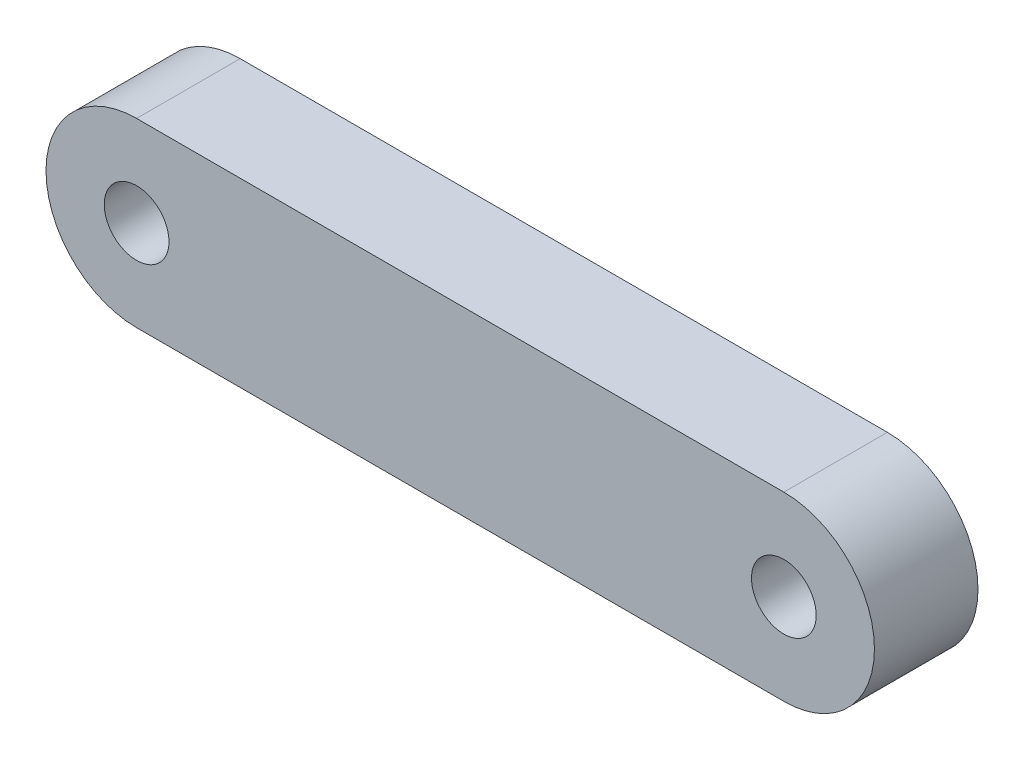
ISO-10303-21;
HEADER;
FILE_DESCRIPTION(('STEP AP214'),'2;1');
FILE_NAME('part.step','',(''),(''),'','','');
FILE_SCHEMA(('AUTOMOTIVE_DESIGN { 1 0 10303 214 1 1 1 1 }'));
ENDSEC;
DATA;
#1=APPLICATION_CONTEXT('core data for automotive mechanical design processes');
#2=APPLICATION_PROTOCOL_DEFINITION('international standard','automotive_design',2000,#1);
#3=PRODUCT_CONTEXT('',#1,'mechanical');
#4=PRODUCT('Part','Part','',(#3));
#5=PRODUCT_RELATED_PRODUCT_CATEGORY('part','',(#4));
#6=PRODUCT_DEFINITION_FORMATION('','',#4);
#7=PRODUCT_DEFINITION_CONTEXT('part definition',#1,'design');
#8=PRODUCT_DEFINITION('design','',#6,#7);
#9=PRODUCT_DEFINITION_SHAPE('','',#8);
#10=(LENGTH_UNIT() NAMED_UNIT(*) SI_UNIT(.MILLI.,.METRE.));
#11=(NAMED_UNIT(*) PLANE_ANGLE_UNIT() SI_UNIT($,.RADIAN.));
#12=(NAMED_UNIT(*) SI_UNIT($,.STERADIAN.) SOLID_ANGLE_UNIT());
#13=UNCERTAINTY_MEASURE_WITH_UNIT(LENGTH_MEASURE(1.E-05),#10,'distance_accuracy_value','');
#14=(GEOMETRIC_REPRESENTATION_CONTEXT(3) GLOBAL_UNCERTAINTY_ASSIGNED_CONTEXT((#13)) GLOBAL_UNIT_ASSIGNED_CONTEXT((#10,
#11,#12)) REPRESENTATION_CONTEXT('',''));
#15=CARTESIAN_POINT('',(0.,0.,0.));
#16=DIRECTION('',(0.,0.,1.));
#17=DIRECTION('',(1.,0.,0.));
#18=AXIS2_PLACEMENT_3D('',#15,#16,#17);
#19=CARTESIAN_POINT('',(-44.45,-29.21,5.08));
#20=DIRECTION('',(0.,0.,-1.));
#21=DIRECTION('',(-1.,0.,0.));
#22=AXIS2_PLACEMENT_3D('',#19,#20,#21);
#23=CYLINDRICAL_SURFACE('',#22,4.445);
#24=CARTESIAN_POINT('',(-44.45,-29.21,0.));
#25=DIRECTION('',(0.,0.,1.));
#26=DIRECTION('',(1.,0.,0.));
#27=AXIS2_PLACEMENT_3D('',#24,#25,#26);
#28=CIRCLE('',#27,4.445);
#29=CARTESIAN_POINT('',(-44.45,-33.655,0.));
#30=VERTEX_POINT('',#29);
#31=CARTESIAN_POINT('',(-44.45,-24.765,0.));
#32=VERTEX_POINT('',#31);
#33=EDGE_CURVE('E94',#30,#32,#28,.T.);
#34=ORIENTED_EDGE('',*,*,#33,.T.);
#35=DIRECTION('',(0.,0.,-1.));
#36=VECTOR('',#35,1.);
#37=CARTESIAN_POINT('',(-44.45,-24.765,5.08));
#38=LINE('',#37,#36);
#39=CARTESIAN_POINT('',(-44.45,-24.765,5.08));
#40=VERTEX_POINT('',#39);
#41=EDGE_CURVE('E11',#40,#32,#38,.T.);
#42=ORIENTED_EDGE('',*,*,#41,.F.);
#43=CARTESIAN_POINT('',(-44.45,-29.21,5.08));
#44=DIRECTION('',(0.,0.,1.));
#45=DIRECTION('',(1.,0.,0.));
#46=AXIS2_PLACEMENT_3D('',#43,#44,#45);
#47=CIRCLE('',#46,4.445);
#48=CARTESIAN_POINT('',(-44.45,-33.655,5.08));
#49=VERTEX_POINT('',#48);
#50=EDGE_CURVE('E82',#49,#40,#47,.T.);
#51=ORIENTED_EDGE('',*,*,#50,.F.);
#52=DIRECTION('',(0.,0.,-1.));
#53=VECTOR('',#52,1.);
#54=CARTESIAN_POINT('',(-44.45,-33.655,5.08));
#55=LINE('',#54,#53);
#56=EDGE_CURVE('E90',#49,#30,#55,.T.);
#57=ORIENTED_EDGE('',*,*,#56,.T.);
#58=EDGE_LOOP('',(#34,#42,#51,#57));
#59=FACE_BOUND('',#58,.T.);
#60=ADVANCED_FACE('F31',(#59),#23,.T.);
#61=CARTESIAN_POINT('',(-44.45,-24.765,5.08));
#62=DIRECTION('',(0.,-1.,0.));
#63=DIRECTION('',(1.,0.,0.));
#64=AXIS2_PLACEMENT_3D('',#61,#62,#63);
#65=PLANE('',#64);
#66=DIRECTION('',(-1.,0.,0.));
#67=VECTOR('',#66,1.);
#68=CARTESIAN_POINT('',(-44.45,-24.765,0.));
#69=LINE('',#68,#67);
#70=CARTESIAN_POINT('',(-76.2,-24.765,0.));
#71=VERTEX_POINT('',#70);
#72=EDGE_CURVE('E86',#32,#71,#69,.T.);
#73=ORIENTED_EDGE('',*,*,#72,.T.);
#74=DIRECTION('',(0.,0.,-1.));
#75=VECTOR('',#74,1.);
#76=CARTESIAN_POINT('',(-76.2,-24.765,5.08));
#77=LINE('',#76,#75);
#78=CARTESIAN_POINT('',(-76.2,-24.765,5.08));
#79=VERTEX_POINT('',#78);
#80=EDGE_CURVE('E39',#79,#71,#77,.T.);
#81=ORIENTED_EDGE('',*,*,#80,.F.);
#82=DIRECTION('',(-1.,0.,0.));
#83=VECTOR('',#82,1.);
#84=CARTESIAN_POINT('',(-44.45,-24.765,5.08));
#85=LINE('',#84,#83);
#86=EDGE_CURVE('E77',#40,#79,#85,.T.);
#87=ORIENTED_EDGE('',*,*,#86,.F.);
#88=ORIENTED_EDGE('',*,*,#41,.T.);
#89=EDGE_LOOP('',(#73,#81,#87,#88));
#90=FACE_BOUND('',#89,.T.);
#91=ADVANCED_FACE('F85',(#90),#65,.F.);
#92=CARTESIAN_POINT('',(-76.2,-29.21,5.08));
#93=DIRECTION('',(0.,0.,-1.));
#94=DIRECTION('',(-1.,0.,0.));
#95=AXIS2_PLACEMENT_3D('',#92,#93,#94);
#96=CYLINDRICAL_SURFACE('',#95,4.445);
#97=CARTESIAN_POINT('',(-76.2,-29.21,0.));
#98=DIRECTION('',(0.,0.,1.));
#99=DIRECTION('',(1.,0.,0.));
#100=AXIS2_PLACEMENT_3D('',#97,#98,#99);
#101=CIRCLE('',#100,4.445);
#102=CARTESIAN_POINT('',(-76.2,-33.655,0.));
#103=VERTEX_POINT('',#102);
#104=EDGE_CURVE('E64',#71,#103,#101,.T.);
#105=ORIENTED_EDGE('',*,*,#104,.T.);
#106=DIRECTION('',(0.,0.,-1.));
#107=VECTOR('',#106,1.);
#108=CARTESIAN_POINT('',(-76.2,-33.655,5.08));
#109=LINE('',#108,#107);
#110=CARTESIAN_POINT('',(-76.2,-33.655,5.08));
#111=VERTEX_POINT('',#110);
#112=EDGE_CURVE('E87',#111,#103,#109,.T.);
#113=ORIENTED_EDGE('',*,*,#112,.F.);
#114=CARTESIAN_POINT('',(-76.2,-29.21,5.08));
#115=DIRECTION('',(0.,0.,1.));
#116=DIRECTION('',(1.,0.,0.));
#117=AXIS2_PLACEMENT_3D('',#114,#115,#116);
#118=CIRCLE('',#117,4.445);
#119=EDGE_CURVE('E80',#79,#111,#118,.T.);
#120=ORIENTED_EDGE('',*,*,#119,.F.);
#121=ORIENTED_EDGE('',*,*,#80,.T.);
#122=EDGE_LOOP('',(#105,#113,#120,#121));
#123=FACE_BOUND('',#122,.T.);
#124=ADVANCED_FACE('F88',(#123),#96,.T.);
#125=CARTESIAN_POINT('',(-44.45,-33.655,5.08));
#126=DIRECTION('',(0.,1.,0.));
#127=DIRECTION('',(-1.,0.,0.));
#128=AXIS2_PLACEMENT_3D('',#125,#126,#127);
#129=PLANE('',#128);
#130=DIRECTION('',(1.,0.,0.));
#131=VECTOR('',#130,1.);
#132=CARTESIAN_POINT('',(-44.45,-33.655,0.));
#133=LINE('',#132,#131);
#134=EDGE_CURVE('E70',#103,#30,#133,.T.);
#135=ORIENTED_EDGE('',*,*,#134,.T.);
#136=ORIENTED_EDGE('',*,*,#56,.F.);
#137=DIRECTION('',(1.,0.,0.));
#138=VECTOR('',#137,1.);
#139=CARTESIAN_POINT('',(-44.45,-33.655,5.08));
#140=LINE('',#139,#138);
#141=EDGE_CURVE('E47',#111,#49,#140,.T.);
#142=ORIENTED_EDGE('',*,*,#141,.F.);
#143=ORIENTED_EDGE('',*,*,#112,.T.);
#144=EDGE_LOOP('',(#135,#136,#142,#143));
#145=FACE_BOUND('',#144,.T.);
#146=ADVANCED_FACE('F102',(#145),#129,.F.);
#147=CARTESIAN_POINT('',(-44.45,-29.21,5.08));
#148=DIRECTION('',(0.,0.,1.));
#149=DIRECTION('',(1.,0.,0.));
#150=AXIS2_PLACEMENT_3D('',#147,#148,#149);
#151=PLANE('',#150);
#152=CARTESIAN_POINT('',(-76.2,-29.21,5.08));
#153=DIRECTION('',(0.,0.,1.));
#154=DIRECTION('',(1.,0.,0.));
#155=AXIS2_PLACEMENT_3D('',#152,#153,#154);
#156=CIRCLE('',#155,1.5875);
#157=CARTESIAN_POINT('',(-74.6125,-29.21,5.08));
#158=VERTEX_POINT('',#157);
#159=EDGE_CURVE('E114',#158,#158,#156,.T.);
#160=ORIENTED_EDGE('',*,*,#159,.F.);
#161=EDGE_LOOP('',(#160));
#162=FACE_BOUND('',#161,.T.);
#163=CARTESIAN_POINT('',(-44.45,-29.21,5.08));
#164=DIRECTION('',(0.,0.,1.));
#165=DIRECTION('',(1.,0.,0.));
#166=AXIS2_PLACEMENT_3D('',#163,#164,#165);
#167=CIRCLE('',#166,1.5875);
#168=CARTESIAN_POINT('',(-42.8625,-29.21,5.08));
#169=VERTEX_POINT('',#168);
#170=EDGE_CURVE('E108',#169,#169,#167,.T.);
#171=ORIENTED_EDGE('',*,*,#170,.F.);
#172=EDGE_LOOP('',(#171));
#173=FACE_BOUND('',#172,.T.);
#174=ORIENTED_EDGE('',*,*,#50,.T.);
#175=ORIENTED_EDGE('',*,*,#86,.T.);
#176=ORIENTED_EDGE('',*,*,#119,.T.);
#177=ORIENTED_EDGE('',*,*,#141,.T.);
#178=EDGE_LOOP('',(#174,#175,#176,#177));
#179=FACE_BOUND('',#178,.T.);
#180=ADVANCED_FACE('F78',(#162,#173,#179),#151,.T.);
#181=CARTESIAN_POINT('',(-44.45,-29.21,0.));
#182=DIRECTION('',(0.,0.,1.));
#183=DIRECTION('',(1.,0.,0.));
#184=AXIS2_PLACEMENT_3D('',#181,#182,#183);
#185=PLANE('',#184);
#186=CARTESIAN_POINT('',(-76.2,-29.21,0.));
#187=DIRECTION('',(0.,0.,1.));
#188=DIRECTION('',(1.,0.,0.));
#189=AXIS2_PLACEMENT_3D('',#186,#187,#188);
#190=CIRCLE('',#189,1.5875);
#191=CARTESIAN_POINT('',(-74.6125,-29.21,0.));
#192=VERTEX_POINT('',#191);
#193=EDGE_CURVE('E111',#192,#192,#190,.T.);
#194=ORIENTED_EDGE('',*,*,#193,.T.);
#195=EDGE_LOOP('',(#194));
#196=FACE_BOUND('',#195,.T.);
#197=CARTESIAN_POINT('',(-44.45,-29.21,0.));
#198=DIRECTION('',(0.,0.,1.));
#199=DIRECTION('',(1.,0.,0.));
#200=AXIS2_PLACEMENT_3D('',#197,#198,#199);
#201=CIRCLE('',#200,1.5875);
#202=CARTESIAN_POINT('',(-42.8625,-29.21,0.));
#203=VERTEX_POINT('',#202);
#204=EDGE_CURVE('E97',#203,#203,#201,.T.);
#205=ORIENTED_EDGE('',*,*,#204,.T.);
#206=EDGE_LOOP('',(#205));
#207=FACE_BOUND('',#206,.T.);
#208=ORIENTED_EDGE('',*,*,#33,.F.);
#209=ORIENTED_EDGE('',*,*,#134,.F.);
#210=ORIENTED_EDGE('',*,*,#104,.F.);
#211=ORIENTED_EDGE('',*,*,#72,.F.);
#212=EDGE_LOOP('',(#208,#209,#210,#211));
#213=FACE_BOUND('',#212,.T.);
#214=ADVANCED_FACE('F105',(#196,#207,#213),#185,.F.);
#215=CARTESIAN_POINT('',(-44.45,-29.21,0.));
#216=DIRECTION('',(0.,0.,1.));
#217=DIRECTION('',(1.,0.,0.));
#218=AXIS2_PLACEMENT_3D('',#215,#216,#217);
#219=CYLINDRICAL_SURFACE('',#218,1.5875);
#220=ORIENTED_EDGE('',*,*,#204,.F.);
#221=EDGE_LOOP('',(#220));
#222=FACE_BOUND('',#221,.T.);
#223=ORIENTED_EDGE('',*,*,#170,.T.);
#224=EDGE_LOOP('',(#223));
#225=FACE_BOUND('',#224,.T.);
#226=ADVANCED_FACE('F125',(#222,#225),#219,.F.);
#227=CARTESIAN_POINT('',(-76.2,-29.21,0.));
#228=DIRECTION('',(0.,0.,1.));
#229=DIRECTION('',(1.,0.,0.));
#230=AXIS2_PLACEMENT_3D('',#227,#228,#229);
#231=CYLINDRICAL_SURFACE('',#230,1.5875);
#232=ORIENTED_EDGE('',*,*,#193,.F.);
#233=EDGE_LOOP('',(#232));
#234=FACE_BOUND('',#233,.T.);
#235=ORIENTED_EDGE('',*,*,#159,.T.);
#236=EDGE_LOOP('',(#235));
#237=FACE_BOUND('',#236,.T.);
#238=ADVANCED_FACE('F122',(#234,#237),#231,.F.);
#239=CLOSED_SHELL('',(#60,#91,#124,#146,#180,#214,#226,#238));
#240=MANIFOLD_SOLID_BREP('B2',#239);
#241=ADVANCED_BREP_SHAPE_REPRESENTATION('',(#18,#240),#14);
#242=SHAPE_DEFINITION_REPRESENTATION(#9,#241);
ENDSEC;
END-ISO-10303-21;
